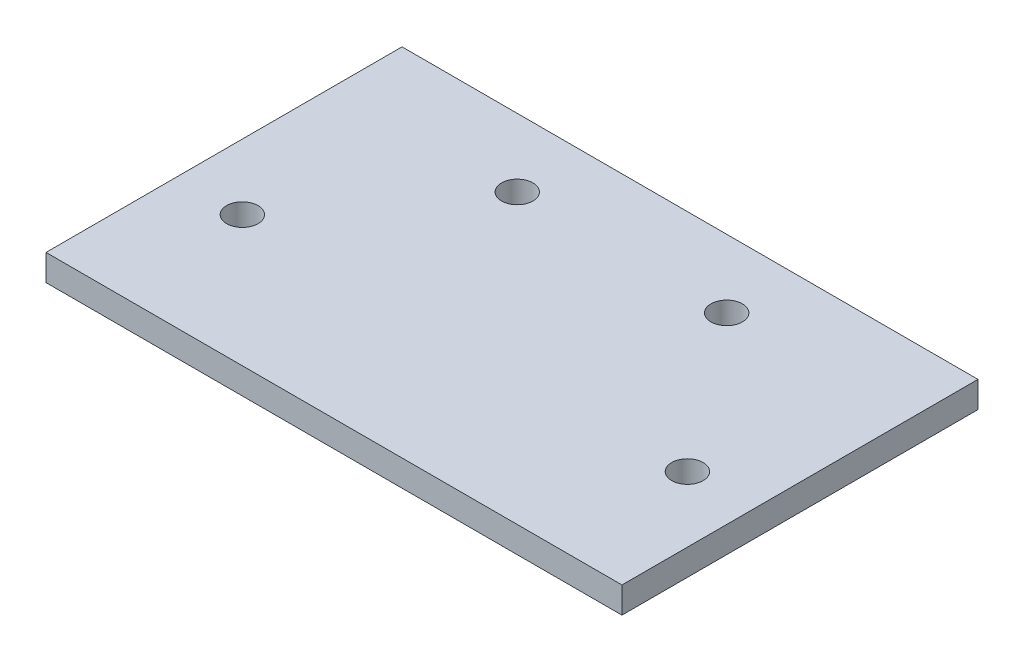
ISO-10303-21;
HEADER;
FILE_DESCRIPTION(('STEP AP214'),'2;1');
FILE_NAME('part.step','',(''),(''),'','','');
FILE_SCHEMA(('AUTOMOTIVE_DESIGN { 1 0 10303 214 1 1 1 1 }'));
ENDSEC;
DATA;
#1=APPLICATION_CONTEXT('core data for automotive mechanical design processes');
#2=APPLICATION_PROTOCOL_DEFINITION('international standard','automotive_design',2000,#1);
#3=PRODUCT_CONTEXT('',#1,'mechanical');
#4=PRODUCT('Part','Part','',(#3));
#5=PRODUCT_RELATED_PRODUCT_CATEGORY('part','',(#4));
#6=PRODUCT_DEFINITION_FORMATION('','',#4);
#7=PRODUCT_DEFINITION_CONTEXT('part definition',#1,'design');
#8=PRODUCT_DEFINITION('design','',#6,#7);
#9=PRODUCT_DEFINITION_SHAPE('','',#8);
#10=(LENGTH_UNIT() NAMED_UNIT(*) SI_UNIT(.MILLI.,.METRE.));
#11=(NAMED_UNIT(*) PLANE_ANGLE_UNIT() SI_UNIT($,.RADIAN.));
#12=(NAMED_UNIT(*) SI_UNIT($,.STERADIAN.) SOLID_ANGLE_UNIT());
#13=UNCERTAINTY_MEASURE_WITH_UNIT(LENGTH_MEASURE(1.E-05),#10,'distance_accuracy_value','');
#14=(GEOMETRIC_REPRESENTATION_CONTEXT(3) GLOBAL_UNCERTAINTY_ASSIGNED_CONTEXT((#13)) GLOBAL_UNIT_ASSIGNED_CONTEXT((#10,
#11,#12)) REPRESENTATION_CONTEXT('',''));
#15=CARTESIAN_POINT('',(0.,0.,0.));
#16=DIRECTION('',(0.,0.,1.));
#17=DIRECTION('',(1.,0.,0.));
#18=AXIS2_PLACEMENT_3D('',#15,#16,#17);
#19=CARTESIAN_POINT('',(0.,5.,-68.));
#20=DIRECTION('',(0.,-1.,0.));
#21=DIRECTION('',(0.,0.,-1.));
#22=AXIS2_PLACEMENT_3D('',#19,#20,#21);
#23=PLANE('',#22);
#24=CARTESIAN_POINT('',(12.5,5.,-25.));
#25=DIRECTION('',(0.,1.,0.));
#26=DIRECTION('',(0.,0.,1.));
#27=AXIS2_PLACEMENT_3D('',#24,#25,#26);
#28=CIRCLE('',#27,3.);
#29=CARTESIAN_POINT('',(12.5,5.,-22.));
#30=VERTEX_POINT('',#29);
#31=EDGE_CURVE('E129',#30,#30,#28,.T.);
#32=ORIENTED_EDGE('',*,*,#31,.F.);
#33=EDGE_LOOP('',(#32));
#34=FACE_BOUND('',#33,.T.);
#35=CARTESIAN_POINT('',(35.,5.,-55.));
#36=DIRECTION('',(0.,1.,0.));
#37=DIRECTION('',(0.,0.,1.));
#38=AXIS2_PLACEMENT_3D('',#35,#36,#37);
#39=CIRCLE('',#38,3.);
#40=CARTESIAN_POINT('',(35.,5.,-52.));
#41=VERTEX_POINT('',#40);
#42=EDGE_CURVE('E91',#41,#41,#39,.T.);
#43=ORIENTED_EDGE('',*,*,#42,.F.);
#44=EDGE_LOOP('',(#43));
#45=FACE_BOUND('',#44,.T.);
#46=DIRECTION('',(0.,0.,1.));
#47=VECTOR('',#46,1.);
#48=CARTESIAN_POINT('',(0.,5.,0.));
#49=LINE('',#48,#47);
#50=CARTESIAN_POINT('',(0.,5.,-68.));
#51=VERTEX_POINT('',#50);
#52=CARTESIAN_POINT('',(0.,5.,0.));
#53=VERTEX_POINT('',#52);
#54=EDGE_CURVE('E101',#51,#53,#49,.T.);
#55=ORIENTED_EDGE('',*,*,#54,.T.);
#56=DIRECTION('',(1.,0.,0.));
#57=VECTOR('',#56,1.);
#58=CARTESIAN_POINT('',(0.,5.,0.));
#59=LINE('',#58,#57);
#60=CARTESIAN_POINT('',(110.,5.,0.));
#61=VERTEX_POINT('',#60);
#62=EDGE_CURVE('E86',#53,#61,#59,.T.);
#63=ORIENTED_EDGE('',*,*,#62,.T.);
#64=DIRECTION('',(0.,0.,-1.));
#65=VECTOR('',#64,1.);
#66=CARTESIAN_POINT('',(110.,5.,0.));
#67=LINE('',#66,#65);
#68=CARTESIAN_POINT('',(110.,5.,-68.));
#69=VERTEX_POINT('',#68);
#70=EDGE_CURVE('E52',#61,#69,#67,.T.);
#71=ORIENTED_EDGE('',*,*,#70,.T.);
#72=DIRECTION('',(-1.,0.,0.));
#73=VECTOR('',#72,1.);
#74=CARTESIAN_POINT('',(0.,5.,-68.));
#75=LINE('',#74,#73);
#76=EDGE_CURVE('E47',#69,#51,#75,.T.);
#77=ORIENTED_EDGE('',*,*,#76,.T.);
#78=EDGE_LOOP('',(#55,#63,#71,#77));
#79=FACE_BOUND('',#78,.T.);
#80=CARTESIAN_POINT('',(75.,5.,-55.));
#81=DIRECTION('',(0.,1.,0.));
#82=DIRECTION('',(0.,0.,1.));
#83=AXIS2_PLACEMENT_3D('',#80,#81,#82);
#84=CIRCLE('',#83,3.00000000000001);
#85=CARTESIAN_POINT('',(75.,5.,-52.));
#86=VERTEX_POINT('',#85);
#87=EDGE_CURVE('E120',#86,#86,#84,.T.);
#88=ORIENTED_EDGE('',*,*,#87,.F.);
#89=EDGE_LOOP('',(#88));
#90=FACE_BOUND('',#89,.T.);
#91=CARTESIAN_POINT('',(97.5,5.,-25.));
#92=DIRECTION('',(0.,1.,0.));
#93=DIRECTION('',(0.,0.,1.));
#94=AXIS2_PLACEMENT_3D('',#91,#92,#93);
#95=CIRCLE('',#94,3.00000000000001);
#96=CARTESIAN_POINT('',(97.5,5.,-22.));
#97=VERTEX_POINT('',#96);
#98=EDGE_CURVE('E123',#97,#97,#95,.T.);
#99=ORIENTED_EDGE('',*,*,#98,.F.);
#100=EDGE_LOOP('',(#99));
#101=FACE_BOUND('',#100,.T.);
#102=ADVANCED_FACE('F32',(#34,#45,#79,#90,#101),#23,.F.);
#103=CARTESIAN_POINT('',(0.,0.,-68.));
#104=DIRECTION('',(0.,-1.,0.));
#105=DIRECTION('',(0.,0.,-1.));
#106=AXIS2_PLACEMENT_3D('',#103,#104,#105);
#107=PLANE('',#106);
#108=CARTESIAN_POINT('',(12.5,0.,-25.));
#109=DIRECTION('',(0.,1.,0.));
#110=DIRECTION('',(0.,0.,1.));
#111=AXIS2_PLACEMENT_3D('',#108,#109,#110);
#112=CIRCLE('',#111,3.);
#113=CARTESIAN_POINT('',(12.5,0.,-22.));
#114=VERTEX_POINT('',#113);
#115=EDGE_CURVE('E125',#114,#114,#112,.T.);
#116=ORIENTED_EDGE('',*,*,#115,.T.);
#117=EDGE_LOOP('',(#116));
#118=FACE_BOUND('',#117,.T.);
#119=CARTESIAN_POINT('',(35.,0.,-55.));
#120=DIRECTION('',(0.,1.,0.));
#121=DIRECTION('',(0.,0.,1.));
#122=AXIS2_PLACEMENT_3D('',#119,#120,#121);
#123=CIRCLE('',#122,3.);
#124=CARTESIAN_POINT('',(35.,0.,-52.));
#125=VERTEX_POINT('',#124);
#126=EDGE_CURVE('E94',#125,#125,#123,.T.);
#127=ORIENTED_EDGE('',*,*,#126,.T.);
#128=EDGE_LOOP('',(#127));
#129=FACE_BOUND('',#128,.T.);
#130=DIRECTION('',(0.,0.,1.));
#131=VECTOR('',#130,1.);
#132=CARTESIAN_POINT('',(0.,0.,0.));
#133=LINE('',#132,#131);
#134=CARTESIAN_POINT('',(0.,0.,-68.));
#135=VERTEX_POINT('',#134);
#136=CARTESIAN_POINT('',(0.,0.,0.));
#137=VERTEX_POINT('',#136);
#138=EDGE_CURVE('E78',#135,#137,#133,.T.);
#139=ORIENTED_EDGE('',*,*,#138,.F.);
#140=DIRECTION('',(-1.,0.,0.));
#141=VECTOR('',#140,1.);
#142=CARTESIAN_POINT('',(0.,0.,-68.));
#143=LINE('',#142,#141);
#144=CARTESIAN_POINT('',(110.,0.,-68.));
#145=VERTEX_POINT('',#144);
#146=EDGE_CURVE('E99',#145,#135,#143,.T.);
#147=ORIENTED_EDGE('',*,*,#146,.F.);
#148=DIRECTION('',(0.,0.,-1.));
#149=VECTOR('',#148,1.);
#150=CARTESIAN_POINT('',(110.,0.,0.));
#151=LINE('',#150,#149);
#152=CARTESIAN_POINT('',(110.,0.,0.));
#153=VERTEX_POINT('',#152);
#154=EDGE_CURVE('E79',#153,#145,#151,.T.);
#155=ORIENTED_EDGE('',*,*,#154,.F.);
#156=DIRECTION('',(1.,0.,0.));
#157=VECTOR('',#156,1.);
#158=CARTESIAN_POINT('',(0.,0.,0.));
#159=LINE('',#158,#157);
#160=EDGE_CURVE('E73',#137,#153,#159,.T.);
#161=ORIENTED_EDGE('',*,*,#160,.F.);
#162=EDGE_LOOP('',(#139,#147,#155,#161));
#163=FACE_BOUND('',#162,.T.);
#164=CARTESIAN_POINT('',(75.,0.,-55.));
#165=DIRECTION('',(0.,1.,0.));
#166=DIRECTION('',(0.,0.,1.));
#167=AXIS2_PLACEMENT_3D('',#164,#165,#166);
#168=CIRCLE('',#167,3.00000000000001);
#169=CARTESIAN_POINT('',(75.,0.,-52.));
#170=VERTEX_POINT('',#169);
#171=EDGE_CURVE('E136',#170,#170,#168,.T.);
#172=ORIENTED_EDGE('',*,*,#171,.T.);
#173=EDGE_LOOP('',(#172));
#174=FACE_BOUND('',#173,.T.);
#175=CARTESIAN_POINT('',(97.5,0.,-25.));
#176=DIRECTION('',(0.,1.,0.));
#177=DIRECTION('',(0.,0.,1.));
#178=AXIS2_PLACEMENT_3D('',#175,#176,#177);
#179=CIRCLE('',#178,3.00000000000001);
#180=CARTESIAN_POINT('',(97.5,0.,-22.));
#181=VERTEX_POINT('',#180);
#182=EDGE_CURVE('E126',#181,#181,#179,.T.);
#183=ORIENTED_EDGE('',*,*,#182,.T.);
#184=EDGE_LOOP('',(#183));
#185=FACE_BOUND('',#184,.T.);
#186=ADVANCED_FACE('F74',(#118,#129,#163,#174,#185),#107,.T.);
#187=CARTESIAN_POINT('',(0.,5.,0.));
#188=DIRECTION('',(1.,0.,0.));
#189=DIRECTION('',(0.,0.,-1.));
#190=AXIS2_PLACEMENT_3D('',#187,#188,#189);
#191=PLANE('',#190);
#192=ORIENTED_EDGE('',*,*,#138,.T.);
#193=DIRECTION('',(0.,-1.,0.));
#194=VECTOR('',#193,1.);
#195=CARTESIAN_POINT('',(0.,5.,0.));
#196=LINE('',#195,#194);
#197=EDGE_CURVE('E11',#53,#137,#196,.T.);
#198=ORIENTED_EDGE('',*,*,#197,.F.);
#199=ORIENTED_EDGE('',*,*,#54,.F.);
#200=DIRECTION('',(0.,-1.,0.));
#201=VECTOR('',#200,1.);
#202=CARTESIAN_POINT('',(0.,5.,-68.));
#203=LINE('',#202,#201);
#204=EDGE_CURVE('E90',#51,#135,#203,.T.);
#205=ORIENTED_EDGE('',*,*,#204,.T.);
#206=EDGE_LOOP('',(#192,#198,#199,#205));
#207=FACE_BOUND('',#206,.T.);
#208=ADVANCED_FACE('F34',(#207),#191,.F.);
#209=CARTESIAN_POINT('',(0.,5.,0.));
#210=DIRECTION('',(0.,0.,-1.));
#211=DIRECTION('',(-1.,0.,0.));
#212=AXIS2_PLACEMENT_3D('',#209,#210,#211);
#213=PLANE('',#212);
#214=ORIENTED_EDGE('',*,*,#160,.T.);
#215=DIRECTION('',(0.,-1.,0.));
#216=VECTOR('',#215,1.);
#217=CARTESIAN_POINT('',(110.,5.,0.));
#218=LINE('',#217,#216);
#219=EDGE_CURVE('E40',#61,#153,#218,.T.);
#220=ORIENTED_EDGE('',*,*,#219,.F.);
#221=ORIENTED_EDGE('',*,*,#62,.F.);
#222=ORIENTED_EDGE('',*,*,#197,.T.);
#223=EDGE_LOOP('',(#214,#220,#221,#222));
#224=FACE_BOUND('',#223,.T.);
#225=ADVANCED_FACE('F85',(#224),#213,.F.);
#226=CARTESIAN_POINT('',(110.,5.,0.));
#227=DIRECTION('',(-1.,0.,0.));
#228=DIRECTION('',(0.,0.,1.));
#229=AXIS2_PLACEMENT_3D('',#226,#227,#228);
#230=PLANE('',#229);
#231=ORIENTED_EDGE('',*,*,#154,.T.);
#232=DIRECTION('',(0.,-1.,0.));
#233=VECTOR('',#232,1.);
#234=CARTESIAN_POINT('',(110.,5.,-68.));
#235=LINE('',#234,#233);
#236=EDGE_CURVE('E107',#69,#145,#235,.T.);
#237=ORIENTED_EDGE('',*,*,#236,.F.);
#238=ORIENTED_EDGE('',*,*,#70,.F.);
#239=ORIENTED_EDGE('',*,*,#219,.T.);
#240=EDGE_LOOP('',(#231,#237,#238,#239));
#241=FACE_BOUND('',#240,.T.);
#242=ADVANCED_FACE('F110',(#241),#230,.F.);
#243=CARTESIAN_POINT('',(0.,5.,-68.));
#244=DIRECTION('',(0.,0.,1.));
#245=DIRECTION('',(1.,0.,0.));
#246=AXIS2_PLACEMENT_3D('',#243,#244,#245);
#247=PLANE('',#246);
#248=ORIENTED_EDGE('',*,*,#146,.T.);
#249=ORIENTED_EDGE('',*,*,#204,.F.);
#250=ORIENTED_EDGE('',*,*,#76,.F.);
#251=ORIENTED_EDGE('',*,*,#236,.T.);
#252=EDGE_LOOP('',(#248,#249,#250,#251));
#253=FACE_BOUND('',#252,.T.);
#254=ADVANCED_FACE('F112',(#253),#247,.F.);
#255=CARTESIAN_POINT('',(35.,5.,-55.));
#256=DIRECTION('',(0.,-1.,0.));
#257=DIRECTION('',(0.,0.,-1.));
#258=AXIS2_PLACEMENT_3D('',#255,#256,#257);
#259=CYLINDRICAL_SURFACE('',#258,3.);
#260=ORIENTED_EDGE('',*,*,#42,.T.);
#261=EDGE_LOOP('',(#260));
#262=FACE_BOUND('',#261,.T.);
#263=ORIENTED_EDGE('',*,*,#126,.F.);
#264=EDGE_LOOP('',(#263));
#265=FACE_BOUND('',#264,.T.);
#266=ADVANCED_FACE('F143',(#262,#265),#259,.F.);
#267=CARTESIAN_POINT('',(75.,5.,-55.));
#268=DIRECTION('',(0.,-1.,0.));
#269=DIRECTION('',(0.,0.,-1.));
#270=AXIS2_PLACEMENT_3D('',#267,#268,#269);
#271=CYLINDRICAL_SURFACE('',#270,3.00000000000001);
#272=ORIENTED_EDGE('',*,*,#87,.T.);
#273=EDGE_LOOP('',(#272));
#274=FACE_BOUND('',#273,.T.);
#275=ORIENTED_EDGE('',*,*,#171,.F.);
#276=EDGE_LOOP('',(#275));
#277=FACE_BOUND('',#276,.T.);
#278=ADVANCED_FACE('F145',(#274,#277),#271,.F.);
#279=CARTESIAN_POINT('',(12.5,5.,-25.));
#280=DIRECTION('',(0.,-1.,0.));
#281=DIRECTION('',(0.,0.,-1.));
#282=AXIS2_PLACEMENT_3D('',#279,#280,#281);
#283=CYLINDRICAL_SURFACE('',#282,3.);
#284=ORIENTED_EDGE('',*,*,#31,.T.);
#285=EDGE_LOOP('',(#284));
#286=FACE_BOUND('',#285,.T.);
#287=ORIENTED_EDGE('',*,*,#115,.F.);
#288=EDGE_LOOP('',(#287));
#289=FACE_BOUND('',#288,.T.);
#290=ADVANCED_FACE('F152',(#286,#289),#283,.F.);
#291=CARTESIAN_POINT('',(97.5,5.,-25.));
#292=DIRECTION('',(0.,-1.,0.));
#293=DIRECTION('',(0.,0.,-1.));
#294=AXIS2_PLACEMENT_3D('',#291,#292,#293);
#295=CYLINDRICAL_SURFACE('',#294,3.00000000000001);
#296=ORIENTED_EDGE('',*,*,#98,.T.);
#297=EDGE_LOOP('',(#296));
#298=FACE_BOUND('',#297,.T.);
#299=ORIENTED_EDGE('',*,*,#182,.F.);
#300=EDGE_LOOP('',(#299));
#301=FACE_BOUND('',#300,.T.);
#302=ADVANCED_FACE('F215',(#298,#301),#295,.F.);
#303=CLOSED_SHELL('',(#102,#186,#208,#225,#242,#254,#266,#278,#290,#302));
#304=MANIFOLD_SOLID_BREP('B2',#303);
#305=ADVANCED_BREP_SHAPE_REPRESENTATION('',(#18,#304),#14);
#306=SHAPE_DEFINITION_REPRESENTATION(#9,#305);
ENDSEC;
END-ISO-10303-21;
